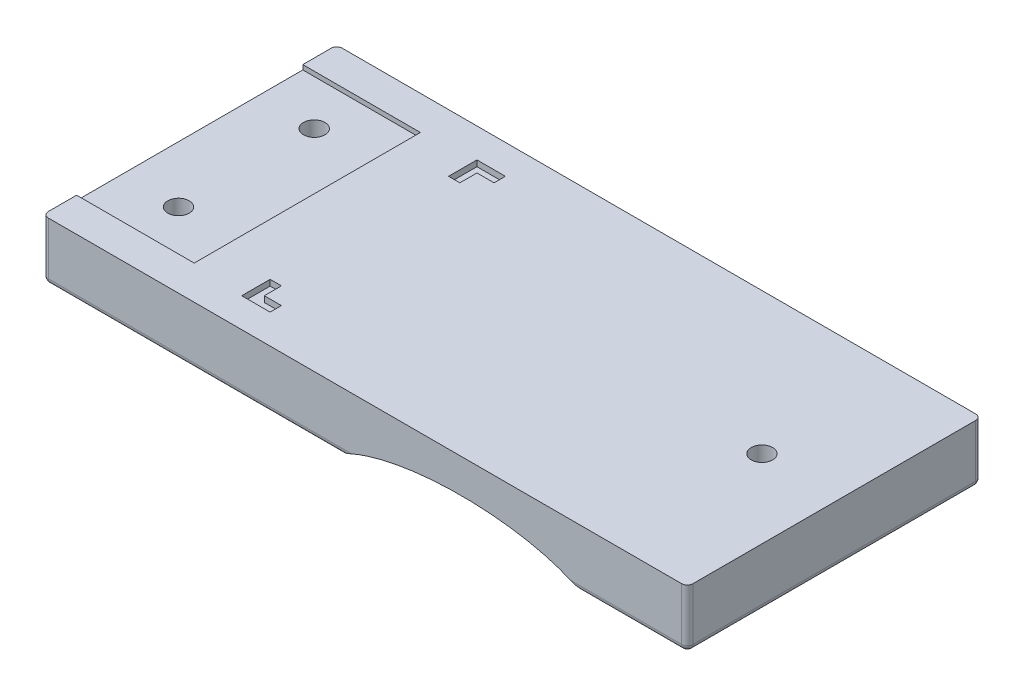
ISO-10303-21;
HEADER;
FILE_DESCRIPTION(('STEP AP214'),'2;1');
FILE_NAME('part.step','',(''),(''),'','','');
FILE_SCHEMA(('AUTOMOTIVE_DESIGN { 1 0 10303 214 1 1 1 1 }'));
ENDSEC;
DATA;
#1=APPLICATION_CONTEXT('core data for automotive mechanical design processes');
#2=APPLICATION_PROTOCOL_DEFINITION('international standard','automotive_design',2000,#1);
#3=PRODUCT_CONTEXT('',#1,'mechanical');
#4=PRODUCT('Part','Part','',(#3));
#5=PRODUCT_RELATED_PRODUCT_CATEGORY('part','',(#4));
#6=PRODUCT_DEFINITION_FORMATION('','',#4);
#7=PRODUCT_DEFINITION_CONTEXT('part definition',#1,'design');
#8=PRODUCT_DEFINITION('design','',#6,#7);
#9=PRODUCT_DEFINITION_SHAPE('','',#8);
#10=(LENGTH_UNIT() NAMED_UNIT(*) SI_UNIT(.MILLI.,.METRE.));
#11=(NAMED_UNIT(*) PLANE_ANGLE_UNIT() SI_UNIT($,.RADIAN.));
#12=(NAMED_UNIT(*) SI_UNIT($,.STERADIAN.) SOLID_ANGLE_UNIT());
#13=UNCERTAINTY_MEASURE_WITH_UNIT(LENGTH_MEASURE(1.E-05),#10,'distance_accuracy_value','');
#14=(GEOMETRIC_REPRESENTATION_CONTEXT(3) GLOBAL_UNCERTAINTY_ASSIGNED_CONTEXT((#13)) GLOBAL_UNIT_ASSIGNED_CONTEXT((#10,
#11,#12)) REPRESENTATION_CONTEXT('',''));
#15=CARTESIAN_POINT('',(0.,0.,0.));
#16=DIRECTION('',(0.,0.,1.));
#17=DIRECTION('',(1.,0.,0.));
#18=AXIS2_PLACEMENT_3D('',#15,#16,#17);
#19=CARTESIAN_POINT('',(0.,0.,0.));
#20=DIRECTION('',(0.,1.,0.));
#21=DIRECTION('',(0.,0.,1.));
#22=AXIS2_PLACEMENT_3D('',#19,#20,#21);
#23=PLANE('',#22);
#24=CARTESIAN_POINT('',(-39.7364066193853,0.,-0.813435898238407));
#25=DIRECTION('',(0.,1.,0.));
#26=DIRECTION('',(0.,0.,1.));
#27=AXIS2_PLACEMENT_3D('',#24,#25,#26);
#28=CIRCLE('',#27,0.95);
#29=CARTESIAN_POINT('',(-39.7364066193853,0.,0.136564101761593));
#30=VERTEX_POINT('',#29);
#31=EDGE_CURVE('E351',#30,#30,#28,.T.);
#32=ORIENTED_EDGE('',*,*,#31,.T.);
#33=EDGE_LOOP('',(#32));
#34=FACE_BOUND('',#33,.T.);
#35=CARTESIAN_POINT('',(-39.7364066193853,0.,11.1865641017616));
#36=DIRECTION('',(0.,1.,0.));
#37=DIRECTION('',(0.,0.,1.));
#38=AXIS2_PLACEMENT_3D('',#35,#36,#37);
#39=CIRCLE('',#38,0.95);
#40=CARTESIAN_POINT('',(-39.7364066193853,0.,12.1365641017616));
#41=VERTEX_POINT('',#40);
#42=EDGE_CURVE('E357',#41,#41,#39,.T.);
#43=ORIENTED_EDGE('',*,*,#42,.T.);
#44=EDGE_LOOP('',(#43));
#45=FACE_BOUND('',#44,.T.);
#46=DIRECTION('',(-1.,0.,0.));
#47=VECTOR('',#46,1.);
#48=CARTESIAN_POINT('',(0.,0.,-7.30141843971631));
#49=LINE('',#48,#47);
#50=CARTESIAN_POINT('',(-44.2364066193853,0.,-7.30141843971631));
#51=VERTEX_POINT('',#50);
#52=CARTESIAN_POINT('',(-18.5303618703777,0.,-7.30141843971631));
#53=VERTEX_POINT('',#52);
#54=EDGE_CURVE('E439',#51,#53,#49,.F.);
#55=ORIENTED_EDGE('',*,*,#54,.T.);
#56=DIRECTION('',(0.,0.,1.));
#57=VECTOR('',#56,1.);
#58=CARTESIAN_POINT('',(-18.5303618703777,0.,0.));
#59=LINE('',#58,#57);
#60=CARTESIAN_POINT('',(-18.5303618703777,0.,17.6985815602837));
#61=VERTEX_POINT('',#60);
#62=EDGE_CURVE('E443',#53,#61,#59,.T.);
#63=ORIENTED_EDGE('',*,*,#62,.T.);
#64=DIRECTION('',(1.,0.,0.));
#65=VECTOR('',#64,1.);
#66=CARTESIAN_POINT('',(0.,0.,17.6985815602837));
#67=LINE('',#66,#65);
#68=CARTESIAN_POINT('',(-44.2364066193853,0.,17.6985815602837));
#69=VERTEX_POINT('',#68);
#70=EDGE_CURVE('E441',#61,#69,#67,.F.);
#71=ORIENTED_EDGE('',*,*,#70,.T.);
#72=DIRECTION('',(0.,0.,1.));
#73=VECTOR('',#72,1.);
#74=CARTESIAN_POINT('',(-44.2364066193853,0.,0.));
#75=LINE('',#74,#73);
#76=EDGE_CURVE('E437',#69,#51,#75,.F.);
#77=ORIENTED_EDGE('',*,*,#76,.T.);
#78=EDGE_LOOP('',(#55,#63,#71,#77));
#79=FACE_BOUND('',#78,.T.);
#80=ADVANCED_FACE('F32',(#34,#45,#79),#23,.F.);
#81=CARTESIAN_POINT('',(-44.7364066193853,5.15,-7.80141843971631));
#82=DIRECTION('',(1.,0.,0.));
#83=DIRECTION('',(0.,0.,-1.));
#84=AXIS2_PLACEMENT_3D('',#81,#82,#83);
#85=PLANE('',#84);
#86=DIRECTION('',(0.,0.,1.));
#87=VECTOR('',#86,1.);
#88=CARTESIAN_POINT('',(-44.7364066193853,5.15,-7.80141843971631));
#89=LINE('',#88,#87);
#90=CARTESIAN_POINT('',(-44.7364066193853,5.15,-7.30141843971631));
#91=VERTEX_POINT('',#90);
#92=CARTESIAN_POINT('',(-44.7364066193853,5.15,-4.80141843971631));
#93=VERTEX_POINT('',#92);
#94=EDGE_CURVE('E648',#91,#93,#89,.T.);
#95=ORIENTED_EDGE('',*,*,#94,.F.);
#96=DIRECTION('',(0.,-1.,0.));
#97=VECTOR('',#96,1.);
#98=CARTESIAN_POINT('',(-44.7364066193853,5.15,-7.30141843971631));
#99=LINE('',#98,#97);
#100=CARTESIAN_POINT('',(-44.7364066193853,0.5,-7.30141843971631));
#101=VERTEX_POINT('',#100);
#102=EDGE_CURVE('E11',#91,#101,#99,.T.);
#103=ORIENTED_EDGE('',*,*,#102,.T.);
#104=DIRECTION('',(0.,0.,1.));
#105=VECTOR('',#104,1.);
#106=CARTESIAN_POINT('',(-44.7364066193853,0.5,-7.80141843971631));
#107=LINE('',#106,#105);
#108=CARTESIAN_POINT('',(-44.7364066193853,0.5,17.6985815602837));
#109=VERTEX_POINT('',#108);
#110=EDGE_CURVE('E446',#101,#109,#107,.T.);
#111=ORIENTED_EDGE('',*,*,#110,.T.);
#112=DIRECTION('',(0.,-1.,0.));
#113=VECTOR('',#112,1.);
#114=CARTESIAN_POINT('',(-44.7364066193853,5.15,17.6985815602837));
#115=LINE('',#114,#113);
#116=CARTESIAN_POINT('',(-44.7364066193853,5.15,17.6985815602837));
#117=VERTEX_POINT('',#116);
#118=EDGE_CURVE('E41',#109,#117,#115,.F.);
#119=ORIENTED_EDGE('',*,*,#118,.T.);
#120=CARTESIAN_POINT('',(-44.7364066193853,5.15,15.1985815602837));
#121=VERTEX_POINT('',#120);
#122=EDGE_CURVE('E651',#121,#117,#89,.T.);
#123=ORIENTED_EDGE('',*,*,#122,.F.);
#124=DIRECTION('',(0.,1.,0.));
#125=VECTOR('',#124,1.);
#126=CARTESIAN_POINT('',(-44.7364066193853,4.74,15.1985815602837));
#127=LINE('',#126,#125);
#128=CARTESIAN_POINT('',(-44.7364066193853,4.74,15.1985815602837));
#129=VERTEX_POINT('',#128);
#130=EDGE_CURVE('E853',#129,#121,#127,.T.);
#131=ORIENTED_EDGE('',*,*,#130,.F.);
#132=DIRECTION('',(0.,0.,1.));
#133=VECTOR('',#132,1.);
#134=CARTESIAN_POINT('',(-44.7364066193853,4.74,-4.80141843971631));
#135=LINE('',#134,#133);
#136=CARTESIAN_POINT('',(-44.7364066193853,4.74,-4.80141843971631));
#137=VERTEX_POINT('',#136);
#138=EDGE_CURVE('E845',#137,#129,#135,.T.);
#139=ORIENTED_EDGE('',*,*,#138,.F.);
#140=DIRECTION('',(0.,1.,0.));
#141=VECTOR('',#140,1.);
#142=CARTESIAN_POINT('',(-44.7364066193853,4.74,-4.80141843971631));
#143=LINE('',#142,#141);
#144=EDGE_CURVE('E864',#137,#93,#143,.T.);
#145=ORIENTED_EDGE('',*,*,#144,.T.);
#146=EDGE_LOOP('',(#95,#103,#111,#119,#123,#131,#139,#145));
#147=FACE_BOUND('',#146,.T.);
#148=ADVANCED_FACE('F514',(#147),#85,.F.);
#149=CARTESIAN_POINT('',(-44.7364066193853,5.15,18.1985815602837));
#150=DIRECTION('',(0.,0.,-1.));
#151=DIRECTION('',(-1.,0.,0.));
#152=AXIS2_PLACEMENT_3D('',#149,#150,#151);
#153=PLANE('',#152);
#154=DIRECTION('',(1.,0.,0.));
#155=VECTOR('',#154,1.);
#156=CARTESIAN_POINT('',(-44.7364066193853,0.5,18.1985815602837));
#157=LINE('',#156,#155);
#158=CARTESIAN_POINT('',(1.93708235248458,0.5,18.1985815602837));
#159=VERTEX_POINT('',#158);
#160=CARTESIAN_POINT('',(11.7635933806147,0.5,18.1985815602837));
#161=VERTEX_POINT('',#160);
#162=EDGE_CURVE('E533',#159,#161,#157,.T.);
#163=ORIENTED_EDGE('',*,*,#162,.T.);
#164=DIRECTION('',(0.,-1.,0.));
#165=VECTOR('',#164,1.);
#166=CARTESIAN_POINT('',(11.7635933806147,5.15,18.1985815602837));
#167=LINE('',#166,#165);
#168=CARTESIAN_POINT('',(11.7635933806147,5.15,18.1985815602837));
#169=VERTEX_POINT('',#168);
#170=EDGE_CURVE('E529',#161,#169,#167,.F.);
#171=ORIENTED_EDGE('',*,*,#170,.T.);
#172=DIRECTION('',(1.,0.,0.));
#173=VECTOR('',#172,1.);
#174=CARTESIAN_POINT('',(-44.7364066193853,5.15,18.1985815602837));
#175=LINE('',#174,#173);
#176=CARTESIAN_POINT('',(-44.2364066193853,5.15,18.1985815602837));
#177=VERTEX_POINT('',#176);
#178=EDGE_CURVE('E645',#177,#169,#175,.T.);
#179=ORIENTED_EDGE('',*,*,#178,.F.);
#180=DIRECTION('',(0.,-1.,0.));
#181=VECTOR('',#180,1.);
#182=CARTESIAN_POINT('',(-44.2364066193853,5.15,18.1985815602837));
#183=LINE('',#182,#181);
#184=CARTESIAN_POINT('',(-44.2364066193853,0.5,18.1985815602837));
#185=VERTEX_POINT('',#184);
#186=EDGE_CURVE('E524',#177,#185,#183,.T.);
#187=ORIENTED_EDGE('',*,*,#186,.T.);
#188=DIRECTION('',(1.,0.,0.));
#189=VECTOR('',#188,1.);
#190=CARTESIAN_POINT('',(-44.7364066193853,0.5,18.1985815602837));
#191=LINE('',#190,#189);
#192=CARTESIAN_POINT('',(-17.4098955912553,0.5,18.1985815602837));
#193=VERTEX_POINT('',#192);
#194=EDGE_CURVE('E569',#185,#193,#191,.T.);
#195=ORIENTED_EDGE('',*,*,#194,.T.);
#196=CARTESIAN_POINT('',(-7.73640661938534,-2.35,18.1985815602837));
#197=DIRECTION('',(0.,0.,1.));
#198=DIRECTION('',(-1.,0.,0.));
#199=AXIS2_PLACEMENT_3D('',#196,#197,#198);
#200=ELLIPSE('',#199,12.5,4.5);
#201=EDGE_CURVE('E366',#159,#193,#200,.T.);
#202=ORIENTED_EDGE('',*,*,#201,.F.);
#203=EDGE_LOOP('',(#163,#171,#179,#187,#195,#202));
#204=FACE_BOUND('',#203,.T.);
#205=ADVANCED_FACE('F586',(#204),#153,.F.);
#206=CARTESIAN_POINT('',(12.2635933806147,5.15,-7.80141843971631));
#207=DIRECTION('',(-1.,0.,0.));
#208=DIRECTION('',(0.,0.,1.));
#209=AXIS2_PLACEMENT_3D('',#206,#207,#208);
#210=PLANE('',#209);
#211=DIRECTION('',(0.,0.,-1.));
#212=VECTOR('',#211,1.);
#213=CARTESIAN_POINT('',(12.2635933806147,5.15,-7.80141843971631));
#214=LINE('',#213,#212);
#215=CARTESIAN_POINT('',(12.2635933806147,5.15,17.6985815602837));
#216=VERTEX_POINT('',#215);
#217=CARTESIAN_POINT('',(12.2635933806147,5.15,-7.30141843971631));
#218=VERTEX_POINT('',#217);
#219=EDGE_CURVE('E647',#216,#218,#214,.T.);
#220=ORIENTED_EDGE('',*,*,#219,.F.);
#221=DIRECTION('',(0.,-1.,0.));
#222=VECTOR('',#221,1.);
#223=CARTESIAN_POINT('',(12.2635933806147,5.15,17.6985815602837));
#224=LINE('',#223,#222);
#225=CARTESIAN_POINT('',(12.2635933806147,0.5,17.6985815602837));
#226=VERTEX_POINT('',#225);
#227=EDGE_CURVE('E637',#216,#226,#224,.T.);
#228=ORIENTED_EDGE('',*,*,#227,.T.);
#229=DIRECTION('',(0.,0.,-1.));
#230=VECTOR('',#229,1.);
#231=CARTESIAN_POINT('',(12.2635933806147,0.5,-7.80141843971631));
#232=LINE('',#231,#230);
#233=CARTESIAN_POINT('',(12.2635933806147,0.5,-7.30141843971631));
#234=VERTEX_POINT('',#233);
#235=EDGE_CURVE('E615',#226,#234,#232,.T.);
#236=ORIENTED_EDGE('',*,*,#235,.T.);
#237=DIRECTION('',(0.,-1.,0.));
#238=VECTOR('',#237,1.);
#239=CARTESIAN_POINT('',(12.2635933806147,5.15,-7.30141843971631));
#240=LINE('',#239,#238);
#241=EDGE_CURVE('E633',#234,#218,#240,.F.);
#242=ORIENTED_EDGE('',*,*,#241,.T.);
#243=EDGE_LOOP('',(#220,#228,#236,#242));
#244=FACE_BOUND('',#243,.T.);
#245=ADVANCED_FACE('F668',(#244),#210,.F.);
#246=CARTESIAN_POINT('',(-44.7364066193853,5.15,-7.80141843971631));
#247=DIRECTION('',(0.,0.,1.));
#248=DIRECTION('',(1.,0.,0.));
#249=AXIS2_PLACEMENT_3D('',#246,#247,#248);
#250=PLANE('',#249);
#251=DIRECTION('',(-1.,0.,0.));
#252=VECTOR('',#251,1.);
#253=CARTESIAN_POINT('',(-44.7364066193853,5.15,-7.80141843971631));
#254=LINE('',#253,#252);
#255=CARTESIAN_POINT('',(11.7635933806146,5.15,-7.80141843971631));
#256=VERTEX_POINT('',#255);
#257=CARTESIAN_POINT('',(-44.2364066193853,5.15,-7.80141843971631));
#258=VERTEX_POINT('',#257);
#259=EDGE_CURVE('E629',#256,#258,#254,.T.);
#260=ORIENTED_EDGE('',*,*,#259,.F.);
#261=DIRECTION('',(0.,-1.,0.));
#262=VECTOR('',#261,1.);
#263=CARTESIAN_POINT('',(11.7635933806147,5.15,-7.80141843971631));
#264=LINE('',#263,#262);
#265=CARTESIAN_POINT('',(11.7635933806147,0.5,-7.80141843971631));
#266=VERTEX_POINT('',#265);
#267=EDGE_CURVE('E545',#256,#266,#264,.T.);
#268=ORIENTED_EDGE('',*,*,#267,.T.);
#269=DIRECTION('',(-1.,0.,0.));
#270=VECTOR('',#269,1.);
#271=CARTESIAN_POINT('',(-44.7364066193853,0.5,-7.80141843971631));
#272=LINE('',#271,#270);
#273=CARTESIAN_POINT('',(1.93708235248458,0.5,-7.80141843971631));
#274=VERTEX_POINT('',#273);
#275=EDGE_CURVE('E543',#266,#274,#272,.T.);
#276=ORIENTED_EDGE('',*,*,#275,.T.);
#277=CARTESIAN_POINT('',(-7.73640661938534,-2.35,-7.80141843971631));
#278=DIRECTION('',(0.,0.,1.));
#279=DIRECTION('',(-1.,0.,0.));
#280=AXIS2_PLACEMENT_3D('',#277,#278,#279);
#281=ELLIPSE('',#280,12.5,4.5);
#282=CARTESIAN_POINT('',(-17.4098955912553,0.5,-7.80141843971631));
#283=VERTEX_POINT('',#282);
#284=EDGE_CURVE('E361',#274,#283,#281,.T.);
#285=ORIENTED_EDGE('',*,*,#284,.T.);
#286=DIRECTION('',(-1.,0.,0.));
#287=VECTOR('',#286,1.);
#288=CARTESIAN_POINT('',(-44.7364066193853,0.5,-7.80141843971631));
#289=LINE('',#288,#287);
#290=CARTESIAN_POINT('',(-44.2364066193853,0.5,-7.80141843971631));
#291=VERTEX_POINT('',#290);
#292=EDGE_CURVE('E501',#283,#291,#289,.T.);
#293=ORIENTED_EDGE('',*,*,#292,.T.);
#294=DIRECTION('',(0.,-1.,0.));
#295=VECTOR('',#294,1.);
#296=CARTESIAN_POINT('',(-44.2364066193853,5.15,-7.80141843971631));
#297=LINE('',#296,#295);
#298=EDGE_CURVE('E540',#291,#258,#297,.F.);
#299=ORIENTED_EDGE('',*,*,#298,.T.);
#300=EDGE_LOOP('',(#260,#268,#276,#285,#293,#299));
#301=FACE_BOUND('',#300,.T.);
#302=ADVANCED_FACE('F601',(#301),#250,.F.);
#303=CARTESIAN_POINT('',(0.,5.15,0.));
#304=DIRECTION('',(0.,1.,0.));
#305=DIRECTION('',(0.,0.,1.));
#306=AXIS2_PLACEMENT_3D('',#303,#304,#305);
#307=PLANE('',#306);
#308=DIRECTION('',(1.,0.,0.));
#309=VECTOR('',#308,1.);
#310=CARTESIAN_POINT('',(-29.7364066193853,5.15,15.5985815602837));
#311=LINE('',#310,#309);
#312=CARTESIAN_POINT('',(-29.7364066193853,5.15,15.5985815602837));
#313=VERTEX_POINT('',#312);
#314=CARTESIAN_POINT('',(-27.2264066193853,5.15,15.5985815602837));
#315=VERTEX_POINT('',#314);
#316=EDGE_CURVE('E49',#313,#315,#311,.T.);
#317=ORIENTED_EDGE('',*,*,#316,.F.);
#318=DIRECTION('',(0.,0.,1.));
#319=VECTOR('',#318,1.);
#320=CARTESIAN_POINT('',(-29.7364066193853,5.15,15.5985815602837));
#321=LINE('',#320,#319);
#322=CARTESIAN_POINT('',(-29.7364066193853,5.15,13.0885815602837));
#323=VERTEX_POINT('',#322);
#324=EDGE_CURVE('E263',#323,#313,#321,.T.);
#325=ORIENTED_EDGE('',*,*,#324,.F.);
#326=DIRECTION('',(-1.,0.,0.));
#327=VECTOR('',#326,1.);
#328=CARTESIAN_POINT('',(-29.7364066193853,5.15,13.0885815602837));
#329=LINE('',#328,#327);
#330=CARTESIAN_POINT('',(-28.7364066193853,5.15,13.0885815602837));
#331=VERTEX_POINT('',#330);
#332=EDGE_CURVE('E266',#331,#323,#329,.T.);
#333=ORIENTED_EDGE('',*,*,#332,.F.);
#334=DIRECTION('',(0.,0.,-1.));
#335=VECTOR('',#334,1.);
#336=CARTESIAN_POINT('',(-28.7364066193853,5.15,13.0885815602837));
#337=LINE('',#336,#335);
#338=CARTESIAN_POINT('',(-28.7364066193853,5.15,14.5985815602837));
#339=VERTEX_POINT('',#338);
#340=EDGE_CURVE('E282',#339,#331,#337,.T.);
#341=ORIENTED_EDGE('',*,*,#340,.F.);
#342=DIRECTION('',(-1.,0.,0.));
#343=VECTOR('',#342,1.);
#344=CARTESIAN_POINT('',(-28.7364066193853,5.15,14.5985815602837));
#345=LINE('',#344,#343);
#346=CARTESIAN_POINT('',(-27.2264066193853,5.15,14.5985815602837));
#347=VERTEX_POINT('',#346);
#348=EDGE_CURVE('E279',#347,#339,#345,.T.);
#349=ORIENTED_EDGE('',*,*,#348,.F.);
#350=DIRECTION('',(0.,0.,-1.));
#351=VECTOR('',#350,1.);
#352=CARTESIAN_POINT('',(-27.2264066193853,5.15,14.5985815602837));
#353=LINE('',#352,#351);
#354=EDGE_CURVE('E277',#315,#347,#353,.T.);
#355=ORIENTED_EDGE('',*,*,#354,.F.);
#356=EDGE_LOOP('',(#317,#325,#333,#341,#349,#355));
#357=FACE_BOUND('',#356,.T.);
#358=DIRECTION('',(0.,0.,1.));
#359=VECTOR('',#358,1.);
#360=CARTESIAN_POINT('',(-29.7364066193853,5.15,-5.20141843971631));
#361=LINE('',#360,#359);
#362=CARTESIAN_POINT('',(-29.7364066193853,5.15,-5.20141843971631));
#363=VERTEX_POINT('',#362);
#364=CARTESIAN_POINT('',(-29.7364066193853,5.15,-2.69141843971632));
#365=VERTEX_POINT('',#364);
#366=EDGE_CURVE('E57',#363,#365,#361,.T.);
#367=ORIENTED_EDGE('',*,*,#366,.F.);
#368=DIRECTION('',(-1.,0.,0.));
#369=VECTOR('',#368,1.);
#370=CARTESIAN_POINT('',(-29.7364066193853,5.15,-5.20141843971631));
#371=LINE('',#370,#369);
#372=CARTESIAN_POINT('',(-27.2264066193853,5.15,-5.20141843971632));
#373=VERTEX_POINT('',#372);
#374=EDGE_CURVE('E300',#373,#363,#371,.T.);
#375=ORIENTED_EDGE('',*,*,#374,.F.);
#376=DIRECTION('',(0.,0.,-1.));
#377=VECTOR('',#376,1.);
#378=CARTESIAN_POINT('',(-27.2264066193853,5.15,-4.20141843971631));
#379=LINE('',#378,#377);
#380=CARTESIAN_POINT('',(-27.2264066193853,5.15,-4.20141843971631));
#381=VERTEX_POINT('',#380);
#382=EDGE_CURVE('E326',#381,#373,#379,.T.);
#383=ORIENTED_EDGE('',*,*,#382,.F.);
#384=DIRECTION('',(1.,0.,0.));
#385=VECTOR('',#384,1.);
#386=CARTESIAN_POINT('',(-28.7364066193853,5.15,-4.20141843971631));
#387=LINE('',#386,#385);
#388=CARTESIAN_POINT('',(-28.7364066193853,5.15,-4.20141843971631));
#389=VERTEX_POINT('',#388);
#390=EDGE_CURVE('E323',#389,#381,#387,.T.);
#391=ORIENTED_EDGE('',*,*,#390,.F.);
#392=DIRECTION('',(0.,0.,-1.));
#393=VECTOR('',#392,1.);
#394=CARTESIAN_POINT('',(-28.7364066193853,5.15,-2.69141843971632));
#395=LINE('',#394,#393);
#396=CARTESIAN_POINT('',(-28.7364066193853,5.15,-2.69141843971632));
#397=VERTEX_POINT('',#396);
#398=EDGE_CURVE('E320',#397,#389,#395,.T.);
#399=ORIENTED_EDGE('',*,*,#398,.F.);
#400=DIRECTION('',(1.,0.,0.));
#401=VECTOR('',#400,1.);
#402=CARTESIAN_POINT('',(-29.7364066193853,5.15,-2.69141843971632));
#403=LINE('',#402,#401);
#404=EDGE_CURVE('E317',#365,#397,#403,.T.);
#405=ORIENTED_EDGE('',*,*,#404,.F.);
#406=EDGE_LOOP('',(#367,#375,#383,#391,#399,#405));
#407=FACE_BOUND('',#406,.T.);
#408=CARTESIAN_POINT('',(5.36359338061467,5.15,4.69858156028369));
#409=DIRECTION('',(0.,1.,0.));
#410=DIRECTION('',(0.,0.,1.));
#411=AXIS2_PLACEMENT_3D('',#408,#409,#410);
#412=CIRCLE('',#411,0.95);
#413=CARTESIAN_POINT('',(5.36359338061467,5.15,5.64858156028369));
#414=VERTEX_POINT('',#413);
#415=EDGE_CURVE('E333',#414,#414,#412,.T.);
#416=ORIENTED_EDGE('',*,*,#415,.F.);
#417=EDGE_LOOP('',(#416));
#418=FACE_BOUND('',#417,.T.);
#419=ORIENTED_EDGE('',*,*,#178,.T.);
#420=CARTESIAN_POINT('',(11.7635933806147,5.15,17.6985815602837));
#421=DIRECTION('',(0.,1.,0.));
#422=DIRECTION('',(0.,0.,1.));
#423=AXIS2_PLACEMENT_3D('',#420,#421,#422);
#424=CIRCLE('',#423,0.5);
#425=EDGE_CURVE('E538',#169,#216,#424,.T.);
#426=ORIENTED_EDGE('',*,*,#425,.T.);
#427=ORIENTED_EDGE('',*,*,#219,.T.);
#428=CARTESIAN_POINT('',(11.7635933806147,5.15,-7.30141843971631));
#429=DIRECTION('',(0.,1.,0.));
#430=DIRECTION('',(0.,0.,1.));
#431=AXIS2_PLACEMENT_3D('',#428,#429,#430);
#432=CIRCLE('',#431,0.5);
#433=EDGE_CURVE('E531',#218,#256,#432,.T.);
#434=ORIENTED_EDGE('',*,*,#433,.T.);
#435=ORIENTED_EDGE('',*,*,#259,.T.);
#436=CARTESIAN_POINT('',(-44.2364066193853,5.15,-7.30141843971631));
#437=DIRECTION('',(0.,1.,0.));
#438=DIRECTION('',(0.,0.,1.));
#439=AXIS2_PLACEMENT_3D('',#436,#437,#438);
#440=CIRCLE('',#439,0.5);
#441=EDGE_CURVE('E528',#258,#91,#440,.T.);
#442=ORIENTED_EDGE('',*,*,#441,.T.);
#443=ORIENTED_EDGE('',*,*,#94,.T.);
#444=DIRECTION('',(-1.,0.,0.));
#445=VECTOR('',#444,1.);
#446=CARTESIAN_POINT('',(-44.7364066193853,5.15,-4.80141843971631));
#447=LINE('',#446,#445);
#448=CARTESIAN_POINT('',(-34.3364066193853,5.15,-4.80141843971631));
#449=VERTEX_POINT('',#448);
#450=EDGE_CURVE('E852',#449,#93,#447,.T.);
#451=ORIENTED_EDGE('',*,*,#450,.F.);
#452=DIRECTION('',(0.,0.,-1.));
#453=VECTOR('',#452,1.);
#454=CARTESIAN_POINT('',(-34.3364066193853,5.15,-4.80141843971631));
#455=LINE('',#454,#453);
#456=CARTESIAN_POINT('',(-34.3364066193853,5.15,15.1985815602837));
#457=VERTEX_POINT('',#456);
#458=EDGE_CURVE('E868',#457,#449,#455,.T.);
#459=ORIENTED_EDGE('',*,*,#458,.F.);
#460=DIRECTION('',(1.,0.,0.));
#461=VECTOR('',#460,1.);
#462=CARTESIAN_POINT('',(-44.7364066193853,5.15,15.1985815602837));
#463=LINE('',#462,#461);
#464=EDGE_CURVE('E365',#121,#457,#463,.T.);
#465=ORIENTED_EDGE('',*,*,#464,.F.);
#466=ORIENTED_EDGE('',*,*,#122,.T.);
#467=CARTESIAN_POINT('',(-44.2364066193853,5.15,17.6985815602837));
#468=DIRECTION('',(0.,1.,0.));
#469=DIRECTION('',(0.,0.,1.));
#470=AXIS2_PLACEMENT_3D('',#467,#468,#469);
#471=CIRCLE('',#470,0.5);
#472=EDGE_CURVE('E523',#117,#177,#471,.T.);
#473=ORIENTED_EDGE('',*,*,#472,.T.);
#474=EDGE_LOOP('',(#419,#426,#427,#434,#435,#442,#443,#451,#459,#465,#466,#473));
#475=FACE_BOUND('',#474,.T.);
#476=ADVANCED_FACE('F593',(#357,#407,#418,#475),#307,.T.);
#477=CARTESIAN_POINT('',(5.36359338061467,0.,4.69858156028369));
#478=DIRECTION('',(0.,1.,0.));
#479=DIRECTION('',(0.,0.,1.));
#480=AXIS2_PLACEMENT_3D('',#477,#478,#479);
#481=CIRCLE('',#480,0.949999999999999);
#482=CARTESIAN_POINT('',(5.36359338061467,0.,5.64858156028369));
#483=VERTEX_POINT('',#482);
#484=EDGE_CURVE('E345',#483,#483,#481,.T.);
#485=ORIENTED_EDGE('',*,*,#484,.T.);
#486=EDGE_LOOP('',(#485));
#487=FACE_BOUND('',#486,.T.);
#488=DIRECTION('',(-1.,0.,0.));
#489=VECTOR('',#488,1.);
#490=CARTESIAN_POINT('',(0.,0.,-7.30141843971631));
#491=LINE('',#490,#489);
#492=CARTESIAN_POINT('',(3.057548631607,0.,-7.30141843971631));
#493=VERTEX_POINT('',#492);
#494=CARTESIAN_POINT('',(11.7635933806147,0.,-7.30141843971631));
#495=VERTEX_POINT('',#494);
#496=EDGE_CURVE('E551',#493,#495,#491,.F.);
#497=ORIENTED_EDGE('',*,*,#496,.T.);
#498=DIRECTION('',(0.,0.,-1.));
#499=VECTOR('',#498,1.);
#500=CARTESIAN_POINT('',(11.7635933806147,0.,0.));
#501=LINE('',#500,#499);
#502=CARTESIAN_POINT('',(11.7635933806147,0.,17.6985815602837));
#503=VERTEX_POINT('',#502);
#504=EDGE_CURVE('E552',#495,#503,#501,.F.);
#505=ORIENTED_EDGE('',*,*,#504,.T.);
#506=DIRECTION('',(1.,0.,0.));
#507=VECTOR('',#506,1.);
#508=CARTESIAN_POINT('',(0.,0.,17.6985815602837));
#509=LINE('',#508,#507);
#510=CARTESIAN_POINT('',(3.057548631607,0.,17.6985815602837));
#511=VERTEX_POINT('',#510);
#512=EDGE_CURVE('E547',#503,#511,#509,.F.);
#513=ORIENTED_EDGE('',*,*,#512,.T.);
#514=DIRECTION('',(0.,0.,1.));
#515=VECTOR('',#514,1.);
#516=CARTESIAN_POINT('',(3.057548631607,0.,0.));
#517=LINE('',#516,#515);
#518=EDGE_CURVE('E549',#511,#493,#517,.F.);
#519=ORIENTED_EDGE('',*,*,#518,.T.);
#520=EDGE_LOOP('',(#497,#505,#513,#519));
#521=FACE_BOUND('',#520,.T.);
#522=ADVANCED_FACE('F582',(#487,#521),#23,.F.);
#523=CARTESIAN_POINT('',(-44.7364066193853,4.74,-4.80141843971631));
#524=DIRECTION('',(0.,0.,-1.));
#525=DIRECTION('',(-1.,0.,0.));
#526=AXIS2_PLACEMENT_3D('',#523,#524,#525);
#527=PLANE('',#526);
#528=ORIENTED_EDGE('',*,*,#450,.T.);
#529=ORIENTED_EDGE('',*,*,#144,.F.);
#530=DIRECTION('',(-1.,0.,0.));
#531=VECTOR('',#530,1.);
#532=CARTESIAN_POINT('',(-44.7364066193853,4.74,-4.80141843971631));
#533=LINE('',#532,#531);
#534=CARTESIAN_POINT('',(-34.3364066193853,4.74,-4.80141843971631));
#535=VERTEX_POINT('',#534);
#536=EDGE_CURVE('E850',#535,#137,#533,.T.);
#537=ORIENTED_EDGE('',*,*,#536,.F.);
#538=DIRECTION('',(0.,1.,0.));
#539=VECTOR('',#538,1.);
#540=CARTESIAN_POINT('',(-34.3364066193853,4.74,-4.80141843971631));
#541=LINE('',#540,#539);
#542=EDGE_CURVE('E858',#535,#449,#541,.T.);
#543=ORIENTED_EDGE('',*,*,#542,.T.);
#544=EDGE_LOOP('',(#528,#529,#537,#543));
#545=FACE_BOUND('',#544,.T.);
#546=ADVANCED_FACE('F592',(#545),#527,.F.);
#547=CARTESIAN_POINT('',(-34.3364066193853,4.74,-4.80141843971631));
#548=DIRECTION('',(1.,0.,0.));
#549=DIRECTION('',(0.,0.,-1.));
#550=AXIS2_PLACEMENT_3D('',#547,#548,#549);
#551=PLANE('',#550);
#552=ORIENTED_EDGE('',*,*,#458,.T.);
#553=ORIENTED_EDGE('',*,*,#542,.F.);
#554=DIRECTION('',(0.,0.,-1.));
#555=VECTOR('',#554,1.);
#556=CARTESIAN_POINT('',(-34.3364066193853,4.74,-4.80141843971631));
#557=LINE('',#556,#555);
#558=CARTESIAN_POINT('',(-34.3364066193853,4.74,15.1985815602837));
#559=VERTEX_POINT('',#558);
#560=EDGE_CURVE('E860',#559,#535,#557,.T.);
#561=ORIENTED_EDGE('',*,*,#560,.F.);
#562=DIRECTION('',(0.,1.,0.));
#563=VECTOR('',#562,1.);
#564=CARTESIAN_POINT('',(-34.3364066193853,4.74,15.1985815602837));
#565=LINE('',#564,#563);
#566=EDGE_CURVE('E857',#559,#457,#565,.T.);
#567=ORIENTED_EDGE('',*,*,#566,.T.);
#568=EDGE_LOOP('',(#552,#553,#561,#567));
#569=FACE_BOUND('',#568,.T.);
#570=ADVANCED_FACE('F599',(#569),#551,.F.);
#571=CARTESIAN_POINT('',(-44.7364066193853,4.74,15.1985815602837));
#572=DIRECTION('',(0.,0.,1.));
#573=DIRECTION('',(1.,0.,0.));
#574=AXIS2_PLACEMENT_3D('',#571,#572,#573);
#575=PLANE('',#574);
#576=ORIENTED_EDGE('',*,*,#464,.T.);
#577=ORIENTED_EDGE('',*,*,#566,.F.);
#578=DIRECTION('',(1.,0.,0.));
#579=VECTOR('',#578,1.);
#580=CARTESIAN_POINT('',(-44.7364066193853,4.74,15.1985815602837));
#581=LINE('',#580,#579);
#582=EDGE_CURVE('E848',#129,#559,#581,.T.);
#583=ORIENTED_EDGE('',*,*,#582,.F.);
#584=ORIENTED_EDGE('',*,*,#130,.T.);
#585=EDGE_LOOP('',(#576,#577,#583,#584));
#586=FACE_BOUND('',#585,.T.);
#587=ADVANCED_FACE('F838',(#586),#575,.F.);
#588=CARTESIAN_POINT('',(0.,4.74,0.));
#589=DIRECTION('',(0.,1.,0.));
#590=DIRECTION('',(0.,0.,1.));
#591=AXIS2_PLACEMENT_3D('',#588,#589,#590);
#592=PLANE('',#591);
#593=CARTESIAN_POINT('',(-39.7364066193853,4.74,-0.813435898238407));
#594=DIRECTION('',(0.,1.,0.));
#595=DIRECTION('',(0.,0.,1.));
#596=AXIS2_PLACEMENT_3D('',#593,#594,#595);
#597=CIRCLE('',#596,0.95);
#598=CARTESIAN_POINT('',(-39.7364066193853,4.74,0.136564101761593));
#599=VERTEX_POINT('',#598);
#600=EDGE_CURVE('E348',#599,#599,#597,.T.);
#601=ORIENTED_EDGE('',*,*,#600,.F.);
#602=EDGE_LOOP('',(#601));
#603=FACE_BOUND('',#602,.T.);
#604=CARTESIAN_POINT('',(-39.7364066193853,4.74,11.1865641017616));
#605=DIRECTION('',(0.,1.,0.));
#606=DIRECTION('',(0.,0.,1.));
#607=AXIS2_PLACEMENT_3D('',#604,#605,#606);
#608=CIRCLE('',#607,0.95);
#609=CARTESIAN_POINT('',(-39.7364066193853,4.74,12.1365641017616));
#610=VERTEX_POINT('',#609);
#611=EDGE_CURVE('E354',#610,#610,#608,.T.);
#612=ORIENTED_EDGE('',*,*,#611,.F.);
#613=EDGE_LOOP('',(#612));
#614=FACE_BOUND('',#613,.T.);
#615=ORIENTED_EDGE('',*,*,#138,.T.);
#616=ORIENTED_EDGE('',*,*,#582,.T.);
#617=ORIENTED_EDGE('',*,*,#560,.T.);
#618=ORIENTED_EDGE('',*,*,#536,.T.);
#619=EDGE_LOOP('',(#615,#616,#617,#618));
#620=FACE_BOUND('',#619,.T.);
#621=ADVANCED_FACE('F375',(#603,#614,#620),#592,.T.);
#622=DIRECTION('',(0.,0.,1.));
#623=VECTOR('',#622,1.);
#624=SURFACE_OF_LINEAR_EXTRUSION('',#281,#623);
#625=ORIENTED_EDGE('',*,*,#284,.F.);
#626=CARTESIAN_POINT('',(1.93708235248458,0.5,-7.80141843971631));
#627=CARTESIAN_POINT('',(1.96841537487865,0.486217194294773,-7.8014137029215));
#628=CARTESIAN_POINT('',(1.99969026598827,0.472292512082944,-7.80084814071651));
#629=CARTESIAN_POINT('',(2.06219005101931,0.444119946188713,-7.79848918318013));
#630=CARTESIAN_POINT('',(2.09341430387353,0.429871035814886,-7.79669113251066));
#631=CARTESIAN_POINT('',(2.15568694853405,0.40109389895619,-7.79175578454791));
#632=CARTESIAN_POINT('',(2.18673500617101,0.386565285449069,-7.78861648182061));
#633=CARTESIAN_POINT('',(2.24985991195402,0.356647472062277,-7.7806885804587));
#634=CARTESIAN_POINT('',(2.28192387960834,0.341248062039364,-7.77583511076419));
#635=CARTESIAN_POINT('',(2.34559007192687,0.310256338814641,-7.76431218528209));
#636=CARTESIAN_POINT('',(2.37719279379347,0.294664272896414,-7.75764486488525));
#637=CARTESIAN_POINT('',(2.43977903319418,0.263364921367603,-7.74222145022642));
#638=CARTESIAN_POINT('',(2.47076315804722,0.247657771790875,-7.73346752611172));
#639=CARTESIAN_POINT('',(2.54541156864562,0.209295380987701,-7.7091137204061));
#640=CARTESIAN_POINT('',(2.58866706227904,0.186618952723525,-7.69219576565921));
#641=CARTESIAN_POINT('',(2.65115547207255,0.153228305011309,-7.66193072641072));
#642=CARTESIAN_POINT('',(2.67147859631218,0.142261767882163,-7.65110169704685));
#643=CARTESIAN_POINT('',(2.71115732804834,0.120651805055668,-7.62753367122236));
#644=CARTESIAN_POINT('',(2.7305139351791,0.110008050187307,-7.61479670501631));
#645=CARTESIAN_POINT('',(2.76004407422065,0.0936263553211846,-7.59289946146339));
#646=CARTESIAN_POINT('',(2.77066393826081,0.0877032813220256,-7.58447980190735));
#647=CARTESIAN_POINT('',(2.79138536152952,0.076089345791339,-7.56677044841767));
#648=CARTESIAN_POINT('',(2.80148430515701,0.0703996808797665,-7.55747692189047));
#649=CARTESIAN_POINT('',(2.81124080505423,0.064876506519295,-7.54772626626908));
#650=B_SPLINE_CURVE_WITH_KNOTS('',3,(#626,#627,#628,#629,#630,#631,#632,#633,#634,#635,#636,
#637,#638,#639,#640,#641,#642,#643,#644,#645,#646,#647,#648,#649),.UNSPECIFIED.,.F.,.F.,(4,2,2,
2,2,2,2,2,2,2,2,4),(0.,0.102692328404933,0.205774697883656,0.309011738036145,0.416669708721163,
0.524201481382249,0.631621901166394,0.786230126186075,0.862682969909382,0.939055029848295,
0.983393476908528,1.02793636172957),.UNSPECIFIED.);
#651=CARTESIAN_POINT('',(2.81124080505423,0.064876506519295,-7.54772626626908));
#652=VERTEX_POINT('',#651);
#653=EDGE_CURVE('E432',#274,#652,#650,.T.);
#654=ORIENTED_EDGE('',*,*,#653,.T.);
#655=DIRECTION('',(0.,0.,1.));
#656=VECTOR('',#655,1.);
#657=CARTESIAN_POINT('',(2.81124080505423,0.064876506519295,-7.80141843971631));
#658=LINE('',#657,#656);
#659=CARTESIAN_POINT('',(2.81124080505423,0.064876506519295,17.9448893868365));
#660=VERTEX_POINT('',#659);
#661=EDGE_CURVE('E405',#652,#660,#658,.T.);
#662=ORIENTED_EDGE('',*,*,#661,.T.);
#663=CARTESIAN_POINT('',(2.81124080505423,0.064876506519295,17.9448893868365));
#664=CARTESIAN_POINT('',(2.79713879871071,0.0728608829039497,17.9589653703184));
#665=CARTESIAN_POINT('',(2.78234384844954,0.0811785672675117,17.9720944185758));
#666=CARTESIAN_POINT('',(2.75171433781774,0.0982672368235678,17.9966374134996));
#667=CARTESIAN_POINT('',(2.73588304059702,0.107036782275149,18.0080564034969));
#668=CARTESIAN_POINT('',(2.70362182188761,0.124765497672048,18.029319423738));
#669=CARTESIAN_POINT('',(2.68720068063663,0.133721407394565,18.0391797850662));
#670=CARTESIAN_POINT('',(2.65375276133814,0.151818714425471,18.0576597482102));
#671=CARTESIAN_POINT('',(2.63672540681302,0.160960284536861,18.0662781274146));
#672=CARTESIAN_POINT('',(2.58706082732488,0.187409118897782,18.0894984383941));
#673=CARTESIAN_POINT('',(2.55384002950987,0.204841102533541,18.10271286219));
#674=CARTESIAN_POINT('',(2.48633867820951,0.239723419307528,18.1260098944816));
#675=CARTESIAN_POINT('',(2.45205756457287,0.257173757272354,18.1360908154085));
#676=CARTESIAN_POINT('',(2.38242370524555,0.292087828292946,18.1537284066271));
#677=CARTESIAN_POINT('',(2.3470637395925,0.309550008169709,18.161259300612));
#678=CARTESIAN_POINT('',(2.27580607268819,0.344214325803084,18.1740513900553));
#679=CARTESIAN_POINT('',(2.23990822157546,0.361416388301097,18.179311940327));
#680=CARTESIAN_POINT('',(2.15950142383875,0.399380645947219,18.1888293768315));
#681=CARTESIAN_POINT('',(2.11489508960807,0.420060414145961,18.1925840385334));
#682=CARTESIAN_POINT('',(2.02591778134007,0.46058605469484,18.1974310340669));
#683=CARTESIAN_POINT('',(1.98155233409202,0.480439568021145,18.198560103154));
#684=CARTESIAN_POINT('',(1.93708235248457,0.500000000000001,18.1985815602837));
#685=B_SPLINE_CURVE_WITH_KNOTS('',3,(#663,#664,#665,#666,#667,#668,#669,#670,#671,#672,#673,
#674,#675,#676,#677,#678,#679,#680,#681,#682,#683,#684),.UNSPECIFIED.,.F.,.F.,(4,2,2,2,2,2,2,2,
2,2,4),(0.,0.0643005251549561,0.128407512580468,0.191790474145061,0.255235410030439,
0.374366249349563,0.493561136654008,0.61392721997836,0.734327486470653,0.88217634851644,
1.02794384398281),.UNSPECIFIED.);
#686=EDGE_CURVE('E399',#660,#159,#685,.T.);
#687=ORIENTED_EDGE('',*,*,#686,.T.);
#688=ORIENTED_EDGE('',*,*,#201,.T.);
#689=CARTESIAN_POINT('',(-17.4098955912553,0.5,18.1985815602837));
#690=CARTESIAN_POINT('',(-17.4412286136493,0.486217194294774,18.1985768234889));
#691=CARTESIAN_POINT('',(-17.472503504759,0.472292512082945,18.1980112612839));
#692=CARTESIAN_POINT('',(-17.53500328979,0.444119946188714,18.1956523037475));
#693=CARTESIAN_POINT('',(-17.5662275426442,0.429871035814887,18.193854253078));
#694=CARTESIAN_POINT('',(-17.6285001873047,0.401093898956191,18.1889189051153));
#695=CARTESIAN_POINT('',(-17.6595482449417,0.386565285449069,18.185779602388));
#696=CARTESIAN_POINT('',(-17.7226731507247,0.356647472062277,18.1778517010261));
#697=CARTESIAN_POINT('',(-17.754737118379,0.341248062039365,18.1729982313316));
#698=CARTESIAN_POINT('',(-17.8184033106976,0.310256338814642,18.1614753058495));
#699=CARTESIAN_POINT('',(-17.8500060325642,0.294664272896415,18.1548079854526));
#700=CARTESIAN_POINT('',(-17.9125922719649,0.263364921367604,18.1393845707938));
#701=CARTESIAN_POINT('',(-17.9435763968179,0.247657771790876,18.1306306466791));
#702=CARTESIAN_POINT('',(-18.0182248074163,0.209295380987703,18.1062768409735));
#703=CARTESIAN_POINT('',(-18.0614803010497,0.186618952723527,18.0893588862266));
#704=CARTESIAN_POINT('',(-18.1239687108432,0.153228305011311,18.0590938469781));
#705=CARTESIAN_POINT('',(-18.1442918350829,0.142261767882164,18.0482648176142));
#706=CARTESIAN_POINT('',(-18.183970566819,0.12065180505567,18.0246967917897));
#707=CARTESIAN_POINT('',(-18.2033271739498,0.110008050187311,18.0119598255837));
#708=CARTESIAN_POINT('',(-18.2328573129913,0.0936263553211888,17.9900625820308));
#709=CARTESIAN_POINT('',(-18.2434771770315,0.0877032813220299,17.9816429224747));
#710=CARTESIAN_POINT('',(-18.2641986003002,0.0760893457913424,17.9639335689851));
#711=CARTESIAN_POINT('',(-18.2742975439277,0.070399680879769,17.9546400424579));
#712=CARTESIAN_POINT('',(-18.2840540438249,0.064876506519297,17.9448893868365));
#713=B_SPLINE_CURVE_WITH_KNOTS('',3,(#689,#690,#691,#692,#693,#694,#695,#696,#697,#698,#699,
#700,#701,#702,#703,#704,#705,#706,#707,#708,#709,#710,#711,#712),.UNSPECIFIED.,.F.,.F.,(4,2,2,
2,2,2,2,2,2,2,2,4),(0.,0.102692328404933,0.205774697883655,0.309011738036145,0.416669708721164,
0.524201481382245,0.631621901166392,0.78623012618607,0.862682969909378,0.939055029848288,
0.983393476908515,1.02793636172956),.UNSPECIFIED.);
#714=CARTESIAN_POINT('',(-18.2840540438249,0.0648765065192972,17.9448893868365));
#715=VERTEX_POINT('',#714);
#716=EDGE_CURVE('E393',#193,#715,#713,.T.);
#717=ORIENTED_EDGE('',*,*,#716,.T.);
#718=DIRECTION('',(0.,0.,1.));
#719=VECTOR('',#718,1.);
#720=CARTESIAN_POINT('',(-18.2840540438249,0.0648765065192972,18.1985815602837));
#721=LINE('',#720,#719);
#722=CARTESIAN_POINT('',(-18.2840540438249,0.0648765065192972,-7.54772626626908));
#723=VERTEX_POINT('',#722);
#724=EDGE_CURVE('E556',#715,#723,#721,.F.);
#725=ORIENTED_EDGE('',*,*,#724,.T.);
#726=CARTESIAN_POINT('',(-18.2840540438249,0.0648765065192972,-7.54772626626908));
#727=CARTESIAN_POINT('',(-18.2699520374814,0.0728608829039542,-7.56180224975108));
#728=CARTESIAN_POINT('',(-18.2551570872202,0.0811785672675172,-7.57493129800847));
#729=CARTESIAN_POINT('',(-18.2245275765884,0.0982672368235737,-7.5994742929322));
#730=CARTESIAN_POINT('',(-18.2086962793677,0.107036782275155,-7.61089328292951));
#731=CARTESIAN_POINT('',(-18.1764350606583,0.124765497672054,-7.63215630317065));
#732=CARTESIAN_POINT('',(-18.1600139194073,0.133721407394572,-7.64201666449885));
#733=CARTESIAN_POINT('',(-18.1265660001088,0.151818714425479,-7.66049662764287));
#734=CARTESIAN_POINT('',(-18.1095386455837,0.160960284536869,-7.66911500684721));
#735=CARTESIAN_POINT('',(-18.0598740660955,0.187409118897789,-7.69233531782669));
#736=CARTESIAN_POINT('',(-18.0266532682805,0.204841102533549,-7.70554974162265));
#737=CARTESIAN_POINT('',(-17.9591519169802,0.239723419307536,-7.72884677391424));
#738=CARTESIAN_POINT('',(-17.9248708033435,0.257173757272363,-7.7389276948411));
#739=CARTESIAN_POINT('',(-17.8552369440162,0.292087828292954,-7.75656528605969));
#740=CARTESIAN_POINT('',(-17.8198769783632,0.309550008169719,-7.76409618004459));
#741=CARTESIAN_POINT('',(-17.7486193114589,0.344214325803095,-7.77688826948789));
#742=CARTESIAN_POINT('',(-17.7127214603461,0.361416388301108,-7.78214881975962));
#743=CARTESIAN_POINT('',(-17.6323146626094,0.399380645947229,-7.79166625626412));
#744=CARTESIAN_POINT('',(-17.5877083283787,0.42006041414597,-7.79542091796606));
#745=CARTESIAN_POINT('',(-17.4987310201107,0.460586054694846,-7.80026791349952));
#746=CARTESIAN_POINT('',(-17.4543655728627,0.480439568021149,-7.80139698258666));
#747=CARTESIAN_POINT('',(-17.4098955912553,0.500000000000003,-7.80141843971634));
#748=B_SPLINE_CURVE_WITH_KNOTS('',3,(#726,#727,#728,#729,#730,#731,#732,#733,#734,#735,#736,
#737,#738,#739,#740,#741,#742,#743,#744,#745,#746,#747),.UNSPECIFIED.,.F.,.F.,(4,2,2,2,2,2,2,2,
2,2,4),(0.,0.0643005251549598,0.12840751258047,0.191790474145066,0.255235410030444,
0.374366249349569,0.493561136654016,0.613927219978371,0.734327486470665,0.882176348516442,
1.0279438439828),.UNSPECIFIED.);
#749=EDGE_CURVE('E383',#723,#283,#748,.T.);
#750=ORIENTED_EDGE('',*,*,#749,.T.);
#751=EDGE_LOOP('',(#625,#654,#662,#687,#688,#717,#725,#750));
#752=FACE_BOUND('',#751,.T.);
#753=ADVANCED_FACE('F369',(#752),#624,.F.);
#754=CARTESIAN_POINT('',(11.7635933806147,5.15,-7.30141843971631));
#755=DIRECTION('',(0.,-1.,0.));
#756=DIRECTION('',(0.,0.,-1.));
#757=AXIS2_PLACEMENT_3D('',#754,#755,#756);
#758=CYLINDRICAL_SURFACE('',#757,0.5);
#759=ORIENTED_EDGE('',*,*,#433,.F.);
#760=ORIENTED_EDGE('',*,*,#241,.F.);
#761=CARTESIAN_POINT('',(11.7635933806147,0.5,-7.30141843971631));
#762=DIRECTION('',(0.,-1.,0.));
#763=DIRECTION('',(0.,0.,-1.));
#764=AXIS2_PLACEMENT_3D('',#761,#762,#763);
#765=CIRCLE('',#764,0.5);
#766=EDGE_CURVE('E468',#266,#234,#765,.T.);
#767=ORIENTED_EDGE('',*,*,#766,.F.);
#768=ORIENTED_EDGE('',*,*,#267,.F.);
#769=EDGE_LOOP('',(#759,#760,#767,#768));
#770=FACE_BOUND('',#769,.T.);
#771=ADVANCED_FACE('F374',(#770),#758,.T.);
#772=CARTESIAN_POINT('',(-44.7364066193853,0.5,-7.30141843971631));
#773=DIRECTION('',(-1.,0.,0.));
#774=DIRECTION('',(0.,0.,1.));
#775=AXIS2_PLACEMENT_3D('',#772,#773,#774);
#776=CYLINDRICAL_SURFACE('',#775,0.5);
#777=ORIENTED_EDGE('',*,*,#653,.F.);
#778=ORIENTED_EDGE('',*,*,#275,.F.);
#779=CARTESIAN_POINT('',(11.7635933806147,0.5,-7.30141843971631));
#780=DIRECTION('',(1.,0.,0.));
#781=DIRECTION('',(0.,0.,-1.));
#782=AXIS2_PLACEMENT_3D('',#779,#780,#781);
#783=CIRCLE('',#782,0.5);
#784=EDGE_CURVE('E465',#495,#266,#783,.T.);
#785=ORIENTED_EDGE('',*,*,#784,.F.);
#786=ORIENTED_EDGE('',*,*,#496,.F.);
#787=CARTESIAN_POINT('',(3.057548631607,0.499999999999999,-7.30141843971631));
#788=DIRECTION('',(-0.707106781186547,0.,0.707106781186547));
#789=DIRECTION('',(0.707106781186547,0.,0.707106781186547));
#790=AXIS2_PLACEMENT_3D('',#787,#788,#789);
#791=ELLIPSE('',#790,0.707106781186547,0.5);
#792=EDGE_CURVE('E462',#652,#493,#791,.T.);
#793=ORIENTED_EDGE('',*,*,#792,.F.);
#794=EDGE_LOOP('',(#777,#778,#785,#786,#793));
#795=FACE_BOUND('',#794,.T.);
#796=ADVANCED_FACE('F425',(#795),#776,.T.);
#797=CARTESIAN_POINT('',(11.7635933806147,0.5,-7.30141843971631));
#798=DIRECTION('',(0.,0.,1.));
#799=DIRECTION('',(1.,0.,0.));
#800=AXIS2_PLACEMENT_3D('',#797,#798,#799);
#801=SPHERICAL_SURFACE('',#800,0.5);
#802=ORIENTED_EDGE('',*,*,#784,.T.);
#803=ORIENTED_EDGE('',*,*,#766,.T.);
#804=CARTESIAN_POINT('',(11.7635933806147,0.5,-7.30141843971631));
#805=DIRECTION('',(0.,0.,-1.));
#806=DIRECTION('',(-1.,0.,0.));
#807=AXIS2_PLACEMENT_3D('',#804,#805,#806);
#808=CIRCLE('',#807,0.5);
#809=EDGE_CURVE('E459',#495,#234,#808,.F.);
#810=ORIENTED_EDGE('',*,*,#809,.F.);
#811=EDGE_LOOP('',(#802,#803,#810));
#812=FACE_BOUND('',#811,.T.);
#813=ADVANCED_FACE('F421',(#812),#801,.T.);
#814=CARTESIAN_POINT('',(3.057548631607,0.499999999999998,5.19858156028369));
#815=DIRECTION('',(0.,0.,1.));
#816=DIRECTION('',(1.,0.,0.));
#817=AXIS2_PLACEMENT_3D('',#814,#815,#816);
#818=CYLINDRICAL_SURFACE('',#817,0.5);
#819=ORIENTED_EDGE('',*,*,#792,.T.);
#820=ORIENTED_EDGE('',*,*,#518,.F.);
#821=CARTESIAN_POINT('',(3.057548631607,0.499999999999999,17.6985815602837));
#822=DIRECTION('',(0.707106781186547,0.,0.707106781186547));
#823=DIRECTION('',(0.707106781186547,0.,-0.707106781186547));
#824=AXIS2_PLACEMENT_3D('',#821,#822,#823);
#825=ELLIPSE('',#824,0.707106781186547,0.5);
#826=EDGE_CURVE('E456',#660,#511,#825,.T.);
#827=ORIENTED_EDGE('',*,*,#826,.F.);
#828=ORIENTED_EDGE('',*,*,#661,.F.);
#829=EDGE_LOOP('',(#819,#820,#827,#828));
#830=FACE_BOUND('',#829,.T.);
#831=ADVANCED_FACE('F417',(#830),#818,.T.);
#832=CARTESIAN_POINT('',(11.7635933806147,0.5,-7.80141843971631));
#833=DIRECTION('',(0.,0.,-1.));
#834=DIRECTION('',(-1.,0.,0.));
#835=AXIS2_PLACEMENT_3D('',#832,#833,#834);
#836=CYLINDRICAL_SURFACE('',#835,0.5);
#837=ORIENTED_EDGE('',*,*,#809,.T.);
#838=ORIENTED_EDGE('',*,*,#235,.F.);
#839=CARTESIAN_POINT('',(11.7635933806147,0.5,17.6985815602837));
#840=DIRECTION('',(0.,0.,1.));
#841=DIRECTION('',(1.,0.,0.));
#842=AXIS2_PLACEMENT_3D('',#839,#840,#841);
#843=CIRCLE('',#842,0.5);
#844=EDGE_CURVE('E453',#503,#226,#843,.T.);
#845=ORIENTED_EDGE('',*,*,#844,.F.);
#846=ORIENTED_EDGE('',*,*,#504,.F.);
#847=EDGE_LOOP('',(#837,#838,#845,#846));
#848=FACE_BOUND('',#847,.T.);
#849=ADVANCED_FACE('F412',(#848),#836,.T.);
#850=CARTESIAN_POINT('',(-44.7364066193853,0.5,17.6985815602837));
#851=DIRECTION('',(1.,0.,0.));
#852=DIRECTION('',(0.,0.,-1.));
#853=AXIS2_PLACEMENT_3D('',#850,#851,#852);
#854=CYLINDRICAL_SURFACE('',#853,0.5);
#855=ORIENTED_EDGE('',*,*,#826,.T.);
#856=ORIENTED_EDGE('',*,*,#512,.F.);
#857=CARTESIAN_POINT('',(11.7635933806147,0.5,17.6985815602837));
#858=DIRECTION('',(1.,0.,0.));
#859=DIRECTION('',(0.,0.,-1.));
#860=AXIS2_PLACEMENT_3D('',#857,#858,#859);
#861=CIRCLE('',#860,0.5);
#862=EDGE_CURVE('E451',#161,#503,#861,.T.);
#863=ORIENTED_EDGE('',*,*,#862,.F.);
#864=ORIENTED_EDGE('',*,*,#162,.F.);
#865=ORIENTED_EDGE('',*,*,#686,.F.);
#866=EDGE_LOOP('',(#855,#856,#863,#864,#865));
#867=FACE_BOUND('',#866,.T.);
#868=ADVANCED_FACE('F406',(#867),#854,.T.);
#869=CARTESIAN_POINT('',(11.7635933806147,0.5,17.6985815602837));
#870=DIRECTION('',(0.,0.,1.));
#871=DIRECTION('',(1.,0.,0.));
#872=AXIS2_PLACEMENT_3D('',#869,#870,#871);
#873=SPHERICAL_SURFACE('',#872,0.5);
#874=ORIENTED_EDGE('',*,*,#862,.T.);
#875=ORIENTED_EDGE('',*,*,#844,.T.);
#876=CARTESIAN_POINT('',(11.7635933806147,0.5,17.6985815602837));
#877=DIRECTION('',(0.,-1.,0.));
#878=DIRECTION('',(0.,0.,-1.));
#879=AXIS2_PLACEMENT_3D('',#876,#877,#878);
#880=CIRCLE('',#879,0.5);
#881=EDGE_CURVE('E449',#161,#226,#880,.F.);
#882=ORIENTED_EDGE('',*,*,#881,.F.);
#883=EDGE_LOOP('',(#874,#875,#882));
#884=FACE_BOUND('',#883,.T.);
#885=ADVANCED_FACE('F411',(#884),#873,.T.);
#886=CARTESIAN_POINT('',(11.7635933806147,5.15,17.6985815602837));
#887=DIRECTION('',(0.,-1.,0.));
#888=DIRECTION('',(0.,0.,-1.));
#889=AXIS2_PLACEMENT_3D('',#886,#887,#888);
#890=CYLINDRICAL_SURFACE('',#889,0.5);
#891=ORIENTED_EDGE('',*,*,#425,.F.);
#892=ORIENTED_EDGE('',*,*,#170,.F.);
#893=ORIENTED_EDGE('',*,*,#881,.T.);
#894=ORIENTED_EDGE('',*,*,#227,.F.);
#895=EDGE_LOOP('',(#891,#892,#893,#894));
#896=FACE_BOUND('',#895,.T.);
#897=ADVANCED_FACE('F656',(#896),#890,.T.);
#898=CARTESIAN_POINT('',(-44.2364066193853,5.15,-7.30141843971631));
#899=DIRECTION('',(0.,-1.,0.));
#900=DIRECTION('',(0.,0.,-1.));
#901=AXIS2_PLACEMENT_3D('',#898,#899,#900);
#902=CYLINDRICAL_SURFACE('',#901,0.5);
#903=ORIENTED_EDGE('',*,*,#441,.F.);
#904=ORIENTED_EDGE('',*,*,#298,.F.);
#905=CARTESIAN_POINT('',(-44.2364066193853,0.5,-7.30141843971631));
#906=DIRECTION('',(0.,-1.,0.));
#907=DIRECTION('',(0.,0.,-1.));
#908=AXIS2_PLACEMENT_3D('',#905,#906,#907);
#909=CIRCLE('',#908,0.5);
#910=EDGE_CURVE('E36',#101,#291,#909,.T.);
#911=ORIENTED_EDGE('',*,*,#910,.F.);
#912=ORIENTED_EDGE('',*,*,#102,.F.);
#913=EDGE_LOOP('',(#903,#904,#911,#912));
#914=FACE_BOUND('',#913,.T.);
#915=ADVANCED_FACE('F34',(#914),#902,.T.);
#916=CARTESIAN_POINT('',(-44.2364066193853,0.5,-7.80141843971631));
#917=DIRECTION('',(0.,0.,1.));
#918=DIRECTION('',(1.,0.,0.));
#919=AXIS2_PLACEMENT_3D('',#916,#917,#918);
#920=CYLINDRICAL_SURFACE('',#919,0.5);
#921=CARTESIAN_POINT('',(-44.2364066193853,0.5,17.6985815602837));
#922=DIRECTION('',(0.,0.,1.));
#923=DIRECTION('',(1.,0.,0.));
#924=AXIS2_PLACEMENT_3D('',#921,#922,#923);
#925=CIRCLE('',#924,0.5);
#926=EDGE_CURVE('E483',#109,#69,#925,.T.);
#927=ORIENTED_EDGE('',*,*,#926,.F.);
#928=ORIENTED_EDGE('',*,*,#110,.F.);
#929=CARTESIAN_POINT('',(-44.2364066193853,0.5,-7.30141843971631));
#930=DIRECTION('',(0.,0.,-1.));
#931=DIRECTION('',(-1.,0.,0.));
#932=AXIS2_PLACEMENT_3D('',#929,#930,#931);
#933=CIRCLE('',#932,0.5);
#934=EDGE_CURVE('E485',#51,#101,#933,.T.);
#935=ORIENTED_EDGE('',*,*,#934,.F.);
#936=ORIENTED_EDGE('',*,*,#76,.F.);
#937=EDGE_LOOP('',(#927,#928,#935,#936));
#938=FACE_BOUND('',#937,.T.);
#939=ADVANCED_FACE('F510',(#938),#920,.T.);
#940=CARTESIAN_POINT('',(-44.2364066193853,5.15,17.6985815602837));
#941=DIRECTION('',(0.,-1.,0.));
#942=DIRECTION('',(0.,0.,-1.));
#943=AXIS2_PLACEMENT_3D('',#940,#941,#942);
#944=CYLINDRICAL_SURFACE('',#943,0.5);
#945=ORIENTED_EDGE('',*,*,#472,.F.);
#946=ORIENTED_EDGE('',*,*,#118,.F.);
#947=CARTESIAN_POINT('',(-44.2364066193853,0.5,17.6985815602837));
#948=DIRECTION('',(0.,-1.,0.));
#949=DIRECTION('',(0.,0.,-1.));
#950=AXIS2_PLACEMENT_3D('',#947,#948,#949);
#951=CIRCLE('',#950,0.5);
#952=EDGE_CURVE('E480',#185,#109,#951,.T.);
#953=ORIENTED_EDGE('',*,*,#952,.F.);
#954=ORIENTED_EDGE('',*,*,#186,.F.);
#955=EDGE_LOOP('',(#945,#946,#953,#954));
#956=FACE_BOUND('',#955,.T.);
#957=ADVANCED_FACE('F520',(#956),#944,.T.);
#958=CARTESIAN_POINT('',(-44.2364066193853,0.5,-7.30141843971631));
#959=DIRECTION('',(0.,0.,1.));
#960=DIRECTION('',(1.,0.,0.));
#961=AXIS2_PLACEMENT_3D('',#958,#959,#960);
#962=SPHERICAL_SURFACE('',#961,0.5);
#963=ORIENTED_EDGE('',*,*,#934,.T.);
#964=ORIENTED_EDGE('',*,*,#910,.T.);
#965=CARTESIAN_POINT('',(-44.2364066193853,0.5,-7.30141843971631));
#966=DIRECTION('',(-1.,0.,0.));
#967=DIRECTION('',(0.,0.,1.));
#968=AXIS2_PLACEMENT_3D('',#965,#966,#967);
#969=CIRCLE('',#968,0.5);
#970=EDGE_CURVE('E477',#51,#291,#969,.F.);
#971=ORIENTED_EDGE('',*,*,#970,.F.);
#972=EDGE_LOOP('',(#963,#964,#971));
#973=FACE_BOUND('',#972,.T.);
#974=ADVANCED_FACE('F492',(#973),#962,.T.);
#975=CARTESIAN_POINT('',(-44.2364066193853,0.5,17.6985815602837));
#976=DIRECTION('',(0.,0.,1.));
#977=DIRECTION('',(1.,0.,0.));
#978=AXIS2_PLACEMENT_3D('',#975,#976,#977);
#979=SPHERICAL_SURFACE('',#978,0.5);
#980=ORIENTED_EDGE('',*,*,#952,.T.);
#981=ORIENTED_EDGE('',*,*,#926,.T.);
#982=CARTESIAN_POINT('',(-44.2364066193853,0.5,17.6985815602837));
#983=DIRECTION('',(-1.,0.,0.));
#984=DIRECTION('',(0.,0.,1.));
#985=AXIS2_PLACEMENT_3D('',#982,#983,#984);
#986=CIRCLE('',#985,0.5);
#987=EDGE_CURVE('E474',#185,#69,#986,.F.);
#988=ORIENTED_EDGE('',*,*,#987,.F.);
#989=EDGE_LOOP('',(#980,#981,#988));
#990=FACE_BOUND('',#989,.T.);
#991=ADVANCED_FACE('F571',(#990),#979,.T.);
#992=CARTESIAN_POINT('',(-44.7364066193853,0.5,-7.30141843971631));
#993=DIRECTION('',(-1.,0.,0.));
#994=DIRECTION('',(0.,0.,1.));
#995=AXIS2_PLACEMENT_3D('',#992,#993,#994);
#996=CYLINDRICAL_SURFACE('',#995,0.5);
#997=ORIENTED_EDGE('',*,*,#292,.F.);
#998=ORIENTED_EDGE('',*,*,#749,.F.);
#999=CARTESIAN_POINT('',(-18.5303618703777,0.500000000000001,-7.30141843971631));
#1000=DIRECTION('',(-0.707106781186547,0.,-0.707106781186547));
#1001=DIRECTION('',(-0.707106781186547,0.,0.707106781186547));
#1002=AXIS2_PLACEMENT_3D('',#999,#1000,#1001);
#1003=ELLIPSE('',#1002,0.707106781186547,0.5);
#1004=EDGE_CURVE('E472',#53,#723,#1003,.F.);
#1005=ORIENTED_EDGE('',*,*,#1004,.F.);
#1006=ORIENTED_EDGE('',*,*,#54,.F.);
#1007=ORIENTED_EDGE('',*,*,#970,.T.);
#1008=EDGE_LOOP('',(#997,#998,#1005,#1006,#1007));
#1009=FACE_BOUND('',#1008,.T.);
#1010=ADVANCED_FACE('F499',(#1009),#996,.T.);
#1011=CARTESIAN_POINT('',(-44.7364066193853,0.5,17.6985815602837));
#1012=DIRECTION('',(1.,0.,0.));
#1013=DIRECTION('',(0.,0.,-1.));
#1014=AXIS2_PLACEMENT_3D('',#1011,#1012,#1013);
#1015=CYLINDRICAL_SURFACE('',#1014,0.5);
#1016=ORIENTED_EDGE('',*,*,#987,.T.);
#1017=ORIENTED_EDGE('',*,*,#70,.F.);
#1018=CARTESIAN_POINT('',(-18.5303618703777,0.500000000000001,17.6985815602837));
#1019=DIRECTION('',(0.707106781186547,0.,-0.707106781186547));
#1020=DIRECTION('',(0.707106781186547,0.,0.707106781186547));
#1021=AXIS2_PLACEMENT_3D('',#1018,#1019,#1020);
#1022=ELLIPSE('',#1021,0.707106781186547,0.5);
#1023=EDGE_CURVE('E360',#715,#61,#1022,.T.);
#1024=ORIENTED_EDGE('',*,*,#1023,.F.);
#1025=ORIENTED_EDGE('',*,*,#716,.F.);
#1026=ORIENTED_EDGE('',*,*,#194,.F.);
#1027=EDGE_LOOP('',(#1016,#1017,#1024,#1025,#1026));
#1028=FACE_BOUND('',#1027,.T.);
#1029=ADVANCED_FACE('F568',(#1028),#1015,.T.);
#1030=CARTESIAN_POINT('',(-18.5303618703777,0.500000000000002,5.19858156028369));
#1031=DIRECTION('',(0.,0.,1.));
#1032=DIRECTION('',(1.,0.,0.));
#1033=AXIS2_PLACEMENT_3D('',#1030,#1031,#1032);
#1034=CYLINDRICAL_SURFACE('',#1033,0.5);
#1035=ORIENTED_EDGE('',*,*,#1004,.T.);
#1036=ORIENTED_EDGE('',*,*,#724,.F.);
#1037=ORIENTED_EDGE('',*,*,#1023,.T.);
#1038=ORIENTED_EDGE('',*,*,#62,.F.);
#1039=EDGE_LOOP('',(#1035,#1036,#1037,#1038));
#1040=FACE_BOUND('',#1039,.T.);
#1041=ADVANCED_FACE('F567',(#1040),#1034,.T.);
#1042=CARTESIAN_POINT('',(-39.7364066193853,4.74,11.1865641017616));
#1043=DIRECTION('',(0.,1.,0.));
#1044=DIRECTION('',(0.,0.,1.));
#1045=AXIS2_PLACEMENT_3D('',#1042,#1043,#1044);
#1046=CYLINDRICAL_SURFACE('',#1045,0.95);
#1047=ORIENTED_EDGE('',*,*,#42,.F.);
#1048=EDGE_LOOP('',(#1047));
#1049=FACE_BOUND('',#1048,.T.);
#1050=ORIENTED_EDGE('',*,*,#611,.T.);
#1051=EDGE_LOOP('',(#1050));
#1052=FACE_BOUND('',#1051,.T.);
#1053=ADVANCED_FACE('F377',(#1049,#1052),#1046,.F.);
#1054=CARTESIAN_POINT('',(-39.7364066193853,4.74,-0.813435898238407));
#1055=DIRECTION('',(0.,1.,0.));
#1056=DIRECTION('',(0.,0.,1.));
#1057=AXIS2_PLACEMENT_3D('',#1054,#1055,#1056);
#1058=CYLINDRICAL_SURFACE('',#1057,0.95);
#1059=ORIENTED_EDGE('',*,*,#31,.F.);
#1060=EDGE_LOOP('',(#1059));
#1061=FACE_BOUND('',#1060,.T.);
#1062=ORIENTED_EDGE('',*,*,#600,.T.);
#1063=EDGE_LOOP('',(#1062));
#1064=FACE_BOUND('',#1063,.T.);
#1065=ADVANCED_FACE('F824',(#1061,#1064),#1058,.F.);
#1066=CARTESIAN_POINT('',(5.36359338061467,5.15,4.69858156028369));
#1067=DIRECTION('',(0.,1.,0.));
#1068=DIRECTION('',(0.,0.,1.));
#1069=AXIS2_PLACEMENT_3D('',#1066,#1067,#1068);
#1070=CYLINDRICAL_SURFACE('',#1069,0.949999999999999);
#1071=ORIENTED_EDGE('',*,*,#484,.F.);
#1072=EDGE_LOOP('',(#1071));
#1073=FACE_BOUND('',#1072,.T.);
#1074=ORIENTED_EDGE('',*,*,#415,.T.);
#1075=EDGE_LOOP('',(#1074));
#1076=FACE_BOUND('',#1075,.T.);
#1077=ADVANCED_FACE('F687',(#1073,#1076),#1070,.F.);
#1078=CARTESIAN_POINT('',(-29.7364066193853,4.63,-5.20141843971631));
#1079=DIRECTION('',(-1.,0.,0.));
#1080=DIRECTION('',(0.,0.,1.));
#1081=AXIS2_PLACEMENT_3D('',#1078,#1079,#1080);
#1082=PLANE('',#1081);
#1083=ORIENTED_EDGE('',*,*,#366,.T.);
#1084=DIRECTION('',(0.,1.,0.));
#1085=VECTOR('',#1084,1.);
#1086=CARTESIAN_POINT('',(-29.7364066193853,4.63,-2.69141843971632));
#1087=LINE('',#1086,#1085);
#1088=CARTESIAN_POINT('',(-29.7364066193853,4.63,-2.69141843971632));
#1089=VERTEX_POINT('',#1088);
#1090=EDGE_CURVE('E315',#1089,#365,#1087,.T.);
#1091=ORIENTED_EDGE('',*,*,#1090,.F.);
#1092=DIRECTION('',(0.,0.,1.));
#1093=VECTOR('',#1092,1.);
#1094=CARTESIAN_POINT('',(-29.7364066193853,4.63,-5.20141843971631));
#1095=LINE('',#1094,#1093);
#1096=CARTESIAN_POINT('',(-29.7364066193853,4.63,-5.20141843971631));
#1097=VERTEX_POINT('',#1096);
#1098=EDGE_CURVE('E296',#1097,#1089,#1095,.T.);
#1099=ORIENTED_EDGE('',*,*,#1098,.F.);
#1100=DIRECTION('',(0.,1.,0.));
#1101=VECTOR('',#1100,1.);
#1102=CARTESIAN_POINT('',(-29.7364066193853,4.63,-5.20141843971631));
#1103=LINE('',#1102,#1101);
#1104=EDGE_CURVE('E331',#1097,#363,#1103,.T.);
#1105=ORIENTED_EDGE('',*,*,#1104,.T.);
#1106=EDGE_LOOP('',(#1083,#1091,#1099,#1105));
#1107=FACE_BOUND('',#1106,.T.);
#1108=ADVANCED_FACE('F691',(#1107),#1082,.F.);
#1109=CARTESIAN_POINT('',(-29.7364066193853,4.63,-5.20141843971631));
#1110=DIRECTION('',(0.,0.,-1.));
#1111=DIRECTION('',(-1.,0.,0.));
#1112=AXIS2_PLACEMENT_3D('',#1109,#1110,#1111);
#1113=PLANE('',#1112);
#1114=ORIENTED_EDGE('',*,*,#374,.T.);
#1115=ORIENTED_EDGE('',*,*,#1104,.F.);
#1116=DIRECTION('',(-1.,0.,0.));
#1117=VECTOR('',#1116,1.);
#1118=CARTESIAN_POINT('',(-29.7364066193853,4.63,-5.20141843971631));
#1119=LINE('',#1118,#1117);
#1120=CARTESIAN_POINT('',(-27.2264066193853,4.63,-5.20141843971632));
#1121=VERTEX_POINT('',#1120);
#1122=EDGE_CURVE('E312',#1121,#1097,#1119,.T.);
#1123=ORIENTED_EDGE('',*,*,#1122,.F.);
#1124=DIRECTION('',(0.,1.,0.));
#1125=VECTOR('',#1124,1.);
#1126=CARTESIAN_POINT('',(-27.2264066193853,4.63,-5.20141843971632));
#1127=LINE('',#1126,#1125);
#1128=EDGE_CURVE('E334',#1121,#373,#1127,.T.);
#1129=ORIENTED_EDGE('',*,*,#1128,.T.);
#1130=EDGE_LOOP('',(#1114,#1115,#1123,#1129));
#1131=FACE_BOUND('',#1130,.T.);
#1132=ADVANCED_FACE('F696',(#1131),#1113,.F.);
#1133=CARTESIAN_POINT('',(-27.2264066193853,4.63,-4.20141843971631));
#1134=DIRECTION('',(1.,0.,0.));
#1135=DIRECTION('',(0.,0.,-1.));
#1136=AXIS2_PLACEMENT_3D('',#1133,#1134,#1135);
#1137=PLANE('',#1136);
#1138=ORIENTED_EDGE('',*,*,#382,.T.);
#1139=ORIENTED_EDGE('',*,*,#1128,.F.);
#1140=DIRECTION('',(0.,0.,-1.));
#1141=VECTOR('',#1140,1.);
#1142=CARTESIAN_POINT('',(-27.2264066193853,4.63,-4.20141843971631));
#1143=LINE('',#1142,#1141);
#1144=CARTESIAN_POINT('',(-27.2264066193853,4.63,-4.20141843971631));
#1145=VERTEX_POINT('',#1144);
#1146=EDGE_CURVE('E309',#1145,#1121,#1143,.T.);
#1147=ORIENTED_EDGE('',*,*,#1146,.F.);
#1148=DIRECTION('',(0.,1.,0.));
#1149=VECTOR('',#1148,1.);
#1150=CARTESIAN_POINT('',(-27.2264066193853,4.63,-4.20141843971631));
#1151=LINE('',#1150,#1149);
#1152=EDGE_CURVE('E336',#1145,#381,#1151,.T.);
#1153=ORIENTED_EDGE('',*,*,#1152,.T.);
#1154=EDGE_LOOP('',(#1138,#1139,#1147,#1153));
#1155=FACE_BOUND('',#1154,.T.);
#1156=ADVANCED_FACE('F705',(#1155),#1137,.F.);
#1157=CARTESIAN_POINT('',(-28.7364066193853,4.63,-4.20141843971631));
#1158=DIRECTION('',(0.,0.,1.));
#1159=DIRECTION('',(1.,0.,0.));
#1160=AXIS2_PLACEMENT_3D('',#1157,#1158,#1159);
#1161=PLANE('',#1160);
#1162=ORIENTED_EDGE('',*,*,#390,.T.);
#1163=ORIENTED_EDGE('',*,*,#1152,.F.);
#1164=DIRECTION('',(1.,0.,0.));
#1165=VECTOR('',#1164,1.);
#1166=CARTESIAN_POINT('',(-28.7364066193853,4.63,-4.20141843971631));
#1167=LINE('',#1166,#1165);
#1168=CARTESIAN_POINT('',(-28.7364066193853,4.63,-4.20141843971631));
#1169=VERTEX_POINT('',#1168);
#1170=EDGE_CURVE('E306',#1169,#1145,#1167,.T.);
#1171=ORIENTED_EDGE('',*,*,#1170,.F.);
#1172=DIRECTION('',(0.,1.,0.));
#1173=VECTOR('',#1172,1.);
#1174=CARTESIAN_POINT('',(-28.7364066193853,4.63,-4.20141843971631));
#1175=LINE('',#1174,#1173);
#1176=EDGE_CURVE('E338',#1169,#389,#1175,.T.);
#1177=ORIENTED_EDGE('',*,*,#1176,.T.);
#1178=EDGE_LOOP('',(#1162,#1163,#1171,#1177));
#1179=FACE_BOUND('',#1178,.T.);
#1180=ADVANCED_FACE('F715',(#1179),#1161,.F.);
#1181=CARTESIAN_POINT('',(-28.7364066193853,4.63,-2.69141843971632));
#1182=DIRECTION('',(1.,0.,0.));
#1183=DIRECTION('',(0.,0.,-1.));
#1184=AXIS2_PLACEMENT_3D('',#1181,#1182,#1183);
#1185=PLANE('',#1184);
#1186=ORIENTED_EDGE('',*,*,#398,.T.);
#1187=ORIENTED_EDGE('',*,*,#1176,.F.);
#1188=DIRECTION('',(0.,0.,-1.));
#1189=VECTOR('',#1188,1.);
#1190=CARTESIAN_POINT('',(-28.7364066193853,4.63,-2.69141843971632));
#1191=LINE('',#1190,#1189);
#1192=CARTESIAN_POINT('',(-28.7364066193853,4.63,-2.69141843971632));
#1193=VERTEX_POINT('',#1192);
#1194=EDGE_CURVE('E303',#1193,#1169,#1191,.T.);
#1195=ORIENTED_EDGE('',*,*,#1194,.F.);
#1196=DIRECTION('',(0.,1.,0.));
#1197=VECTOR('',#1196,1.);
#1198=CARTESIAN_POINT('',(-28.7364066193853,4.63,-2.69141843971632));
#1199=LINE('',#1198,#1197);
#1200=EDGE_CURVE('E340',#1193,#397,#1199,.T.);
#1201=ORIENTED_EDGE('',*,*,#1200,.T.);
#1202=EDGE_LOOP('',(#1186,#1187,#1195,#1201));
#1203=FACE_BOUND('',#1202,.T.);
#1204=ADVANCED_FACE('F725',(#1203),#1185,.F.);
#1205=CARTESIAN_POINT('',(-29.7364066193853,4.63,-2.69141843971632));
#1206=DIRECTION('',(0.,0.,1.));
#1207=DIRECTION('',(1.,0.,0.));
#1208=AXIS2_PLACEMENT_3D('',#1205,#1206,#1207);
#1209=PLANE('',#1208);
#1210=ORIENTED_EDGE('',*,*,#404,.T.);
#1211=ORIENTED_EDGE('',*,*,#1200,.F.);
#1212=DIRECTION('',(1.,0.,0.));
#1213=VECTOR('',#1212,1.);
#1214=CARTESIAN_POINT('',(-29.7364066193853,4.63,-2.69141843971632));
#1215=LINE('',#1214,#1213);
#1216=EDGE_CURVE('E299',#1089,#1193,#1215,.T.);
#1217=ORIENTED_EDGE('',*,*,#1216,.F.);
#1218=ORIENTED_EDGE('',*,*,#1090,.T.);
#1219=EDGE_LOOP('',(#1210,#1211,#1217,#1218));
#1220=FACE_BOUND('',#1219,.T.);
#1221=ADVANCED_FACE('F735',(#1220),#1209,.F.);
#1222=CARTESIAN_POINT('',(0.,4.63,0.));
#1223=DIRECTION('',(0.,1.,0.));
#1224=DIRECTION('',(0.,0.,1.));
#1225=AXIS2_PLACEMENT_3D('',#1222,#1223,#1224);
#1226=PLANE('',#1225);
#1227=ORIENTED_EDGE('',*,*,#1098,.T.);
#1228=ORIENTED_EDGE('',*,*,#1216,.T.);
#1229=ORIENTED_EDGE('',*,*,#1194,.T.);
#1230=ORIENTED_EDGE('',*,*,#1170,.T.);
#1231=ORIENTED_EDGE('',*,*,#1146,.T.);
#1232=ORIENTED_EDGE('',*,*,#1122,.T.);
#1233=EDGE_LOOP('',(#1227,#1228,#1229,#1230,#1231,#1232));
#1234=FACE_BOUND('',#1233,.T.);
#1235=ADVANCED_FACE('F745',(#1234),#1226,.T.);
#1236=CARTESIAN_POINT('',(-29.7364066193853,4.63,15.5985815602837));
#1237=DIRECTION('',(0.,0.,1.));
#1238=DIRECTION('',(1.,0.,0.));
#1239=AXIS2_PLACEMENT_3D('',#1236,#1237,#1238);
#1240=PLANE('',#1239);
#1241=ORIENTED_EDGE('',*,*,#316,.T.);
#1242=DIRECTION('',(0.,1.,0.));
#1243=VECTOR('',#1242,1.);
#1244=CARTESIAN_POINT('',(-27.2264066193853,4.63,15.5985815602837));
#1245=LINE('',#1244,#1243);
#1246=CARTESIAN_POINT('',(-27.2264066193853,4.63,15.5985815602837));
#1247=VERTEX_POINT('',#1246);
#1248=EDGE_CURVE('E240',#1247,#315,#1245,.T.);
#1249=ORIENTED_EDGE('',*,*,#1248,.F.);
#1250=DIRECTION('',(1.,0.,0.));
#1251=VECTOR('',#1250,1.);
#1252=CARTESIAN_POINT('',(-29.7364066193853,4.63,15.5985815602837));
#1253=LINE('',#1252,#1251);
#1254=CARTESIAN_POINT('',(-29.7364066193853,4.63,15.5985815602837));
#1255=VERTEX_POINT('',#1254);
#1256=EDGE_CURVE('E244',#1255,#1247,#1253,.T.);
#1257=ORIENTED_EDGE('',*,*,#1256,.F.);
#1258=DIRECTION('',(0.,1.,0.));
#1259=VECTOR('',#1258,1.);
#1260=CARTESIAN_POINT('',(-29.7364066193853,4.63,15.5985815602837));
#1261=LINE('',#1260,#1259);
#1262=EDGE_CURVE('E287',#1255,#313,#1261,.T.);
#1263=ORIENTED_EDGE('',*,*,#1262,.T.);
#1264=EDGE_LOOP('',(#1241,#1249,#1257,#1263));
#1265=FACE_BOUND('',#1264,.T.);
#1266=ADVANCED_FACE('F242',(#1265),#1240,.F.);
#1267=CARTESIAN_POINT('',(-29.7364066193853,4.63,15.5985815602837));
#1268=DIRECTION('',(-1.,0.,0.));
#1269=DIRECTION('',(0.,0.,1.));
#1270=AXIS2_PLACEMENT_3D('',#1267,#1268,#1269);
#1271=PLANE('',#1270);
#1272=ORIENTED_EDGE('',*,*,#324,.T.);
#1273=ORIENTED_EDGE('',*,*,#1262,.F.);
#1274=DIRECTION('',(0.,0.,1.));
#1275=VECTOR('',#1274,1.);
#1276=CARTESIAN_POINT('',(-29.7364066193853,4.63,15.5985815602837));
#1277=LINE('',#1276,#1275);
#1278=CARTESIAN_POINT('',(-29.7364066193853,4.63,13.0885815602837));
#1279=VERTEX_POINT('',#1278);
#1280=EDGE_CURVE('E250',#1279,#1255,#1277,.T.);
#1281=ORIENTED_EDGE('',*,*,#1280,.F.);
#1282=DIRECTION('',(0.,1.,0.));
#1283=VECTOR('',#1282,1.);
#1284=CARTESIAN_POINT('',(-29.7364066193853,4.63,13.0885815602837));
#1285=LINE('',#1284,#1283);
#1286=EDGE_CURVE('E289',#1279,#323,#1285,.T.);
#1287=ORIENTED_EDGE('',*,*,#1286,.T.);
#1288=EDGE_LOOP('',(#1272,#1273,#1281,#1287));
#1289=FACE_BOUND('',#1288,.T.);
#1290=ADVANCED_FACE('F764',(#1289),#1271,.F.);
#1291=CARTESIAN_POINT('',(-29.7364066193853,4.63,13.0885815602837));
#1292=DIRECTION('',(0.,0.,-1.));
#1293=DIRECTION('',(-1.,0.,0.));
#1294=AXIS2_PLACEMENT_3D('',#1291,#1292,#1293);
#1295=PLANE('',#1294);
#1296=ORIENTED_EDGE('',*,*,#332,.T.);
#1297=ORIENTED_EDGE('',*,*,#1286,.F.);
#1298=DIRECTION('',(-1.,0.,0.));
#1299=VECTOR('',#1298,1.);
#1300=CARTESIAN_POINT('',(-29.7364066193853,4.63,13.0885815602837));
#1301=LINE('',#1300,#1299);
#1302=CARTESIAN_POINT('',(-28.7364066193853,4.63,13.0885815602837));
#1303=VERTEX_POINT('',#1302);
#1304=EDGE_CURVE('E273',#1303,#1279,#1301,.T.);
#1305=ORIENTED_EDGE('',*,*,#1304,.F.);
#1306=DIRECTION('',(0.,1.,0.));
#1307=VECTOR('',#1306,1.);
#1308=CARTESIAN_POINT('',(-28.7364066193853,4.63,13.0885815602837));
#1309=LINE('',#1308,#1307);
#1310=EDGE_CURVE('E291',#1303,#331,#1309,.T.);
#1311=ORIENTED_EDGE('',*,*,#1310,.T.);
#1312=EDGE_LOOP('',(#1296,#1297,#1305,#1311));
#1313=FACE_BOUND('',#1312,.T.);
#1314=ADVANCED_FACE('F773',(#1313),#1295,.F.);
#1315=CARTESIAN_POINT('',(-28.7364066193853,4.63,13.0885815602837));
#1316=DIRECTION('',(1.,0.,0.));
#1317=DIRECTION('',(0.,0.,-1.));
#1318=AXIS2_PLACEMENT_3D('',#1315,#1316,#1317);
#1319=PLANE('',#1318);
#1320=ORIENTED_EDGE('',*,*,#340,.T.);
#1321=ORIENTED_EDGE('',*,*,#1310,.F.);
#1322=DIRECTION('',(0.,0.,-1.));
#1323=VECTOR('',#1322,1.);
#1324=CARTESIAN_POINT('',(-28.7364066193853,4.63,13.0885815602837));
#1325=LINE('',#1324,#1323);
#1326=CARTESIAN_POINT('',(-28.7364066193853,4.63,14.5985815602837));
#1327=VERTEX_POINT('',#1326);
#1328=EDGE_CURVE('E270',#1327,#1303,#1325,.T.);
#1329=ORIENTED_EDGE('',*,*,#1328,.F.);
#1330=DIRECTION('',(0.,1.,0.));
#1331=VECTOR('',#1330,1.);
#1332=CARTESIAN_POINT('',(-28.7364066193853,4.63,14.5985815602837));
#1333=LINE('',#1332,#1331);
#1334=EDGE_CURVE('E293',#1327,#339,#1333,.T.);
#1335=ORIENTED_EDGE('',*,*,#1334,.T.);
#1336=EDGE_LOOP('',(#1320,#1321,#1329,#1335));
#1337=FACE_BOUND('',#1336,.T.);
#1338=ADVANCED_FACE('F783',(#1337),#1319,.F.);
#1339=CARTESIAN_POINT('',(-28.7364066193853,4.63,14.5985815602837));
#1340=DIRECTION('',(0.,0.,-1.));
#1341=DIRECTION('',(-1.,0.,0.));
#1342=AXIS2_PLACEMENT_3D('',#1339,#1340,#1341);
#1343=PLANE('',#1342);
#1344=ORIENTED_EDGE('',*,*,#348,.T.);
#1345=ORIENTED_EDGE('',*,*,#1334,.F.);
#1346=DIRECTION('',(-1.,0.,0.));
#1347=VECTOR('',#1346,1.);
#1348=CARTESIAN_POINT('',(-28.7364066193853,4.63,14.5985815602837));
#1349=LINE('',#1348,#1347);
#1350=CARTESIAN_POINT('',(-27.2264066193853,4.63,14.5985815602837));
#1351=VERTEX_POINT('',#1350);
#1352=EDGE_CURVE('E258',#1351,#1327,#1349,.T.);
#1353=ORIENTED_EDGE('',*,*,#1352,.F.);
#1354=DIRECTION('',(0.,1.,0.));
#1355=VECTOR('',#1354,1.);
#1356=CARTESIAN_POINT('',(-27.2264066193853,4.63,14.5985815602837));
#1357=LINE('',#1356,#1355);
#1358=EDGE_CURVE('E249',#1351,#347,#1357,.T.);
#1359=ORIENTED_EDGE('',*,*,#1358,.T.);
#1360=EDGE_LOOP('',(#1344,#1345,#1353,#1359));
#1361=FACE_BOUND('',#1360,.T.);
#1362=ADVANCED_FACE('F793',(#1361),#1343,.F.);
#1363=CARTESIAN_POINT('',(-27.2264066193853,4.63,14.5985815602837));
#1364=DIRECTION('',(1.,0.,0.));
#1365=DIRECTION('',(0.,0.,-1.));
#1366=AXIS2_PLACEMENT_3D('',#1363,#1364,#1365);
#1367=PLANE('',#1366);
#1368=ORIENTED_EDGE('',*,*,#354,.T.);
#1369=ORIENTED_EDGE('',*,*,#1358,.F.);
#1370=DIRECTION('',(0.,0.,-1.));
#1371=VECTOR('',#1370,1.);
#1372=CARTESIAN_POINT('',(-27.2264066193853,4.63,14.5985815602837));
#1373=LINE('',#1372,#1371);
#1374=EDGE_CURVE('E253',#1247,#1351,#1373,.T.);
#1375=ORIENTED_EDGE('',*,*,#1374,.F.);
#1376=ORIENTED_EDGE('',*,*,#1248,.T.);
#1377=EDGE_LOOP('',(#1368,#1369,#1375,#1376));
#1378=FACE_BOUND('',#1377,.T.);
#1379=ADVANCED_FACE('F254',(#1378),#1367,.F.);
#1380=CARTESIAN_POINT('',(0.,4.63,0.));
#1381=DIRECTION('',(0.,-1.,0.));
#1382=DIRECTION('',(0.,0.,-1.));
#1383=AXIS2_PLACEMENT_3D('',#1380,#1381,#1382);
#1384=PLANE('',#1383);
#1385=ORIENTED_EDGE('',*,*,#1256,.T.);
#1386=ORIENTED_EDGE('',*,*,#1374,.T.);
#1387=ORIENTED_EDGE('',*,*,#1352,.T.);
#1388=ORIENTED_EDGE('',*,*,#1328,.T.);
#1389=ORIENTED_EDGE('',*,*,#1304,.T.);
#1390=ORIENTED_EDGE('',*,*,#1280,.T.);
#1391=EDGE_LOOP('',(#1385,#1386,#1387,#1388,#1389,#1390));
#1392=FACE_BOUND('',#1391,.T.);
#1393=ADVANCED_FACE('F260',(#1392),#1384,.F.);
#1394=CLOSED_SHELL('',(#80,#148,#205,#245,#302,#476,#522,#546,#570,#587,#621,#753,#771,#796,
#813,#831,#849,#868,#885,#897,#915,#939,#957,#974,#991,#1010,#1029,#1041,#1053,#1065,#1077,
#1108,#1132,#1156,#1180,#1204,#1221,#1235,#1266,#1290,#1314,#1338,#1362,#1379,#1393));
#1395=MANIFOLD_SOLID_BREP('B2',#1394);
#1396=ADVANCED_BREP_SHAPE_REPRESENTATION('',(#18,#1395),#14);
#1397=SHAPE_DEFINITION_REPRESENTATION(#9,#1396);
ENDSEC;
END-ISO-10303-21;
